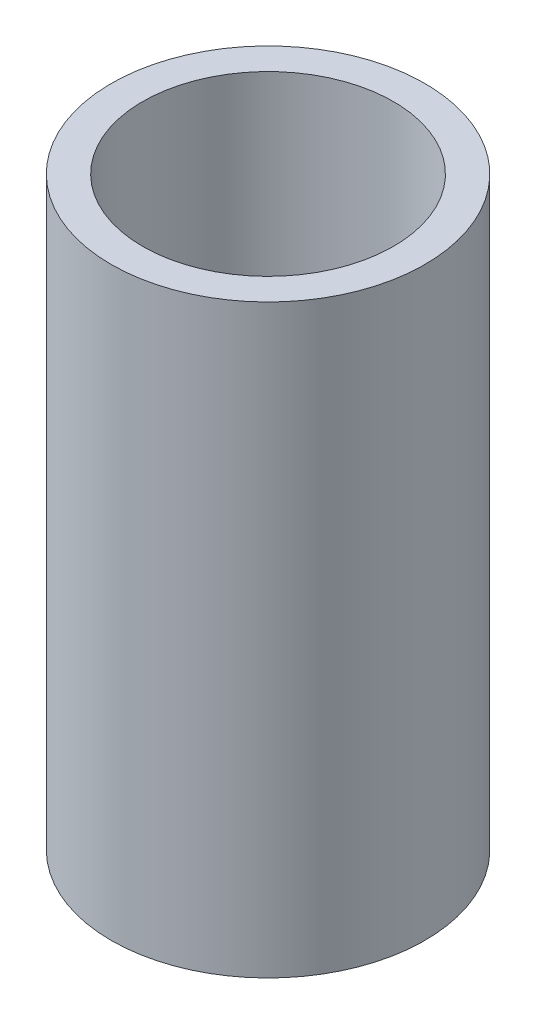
from build123d import *

# Parameters (mm, degrees)
SKETCH1_R           = 7.5
SKETCH1_R_2         = 6
BOSS_EXTRUDE1_DEPTH = 14


with BuildPart() as part:
    # Sketch1 → Boss-Extrude1 (new, symmetric)
    with BuildSketch(Plane(origin=(0, 0, 0), x_dir=(1, 0, 0), z_dir=(0, 1, 0))):
        with Locations(Location((0, 0, 0), (0, 0, 270))):
            Circle(SKETCH1_R)
        with Locations(Location((0, 0, 0), (0, 0, 270))):
            Circle(SKETCH1_R_2, mode=Mode.SUBTRACT)
    extrude(amount=BOSS_EXTRUDE1_DEPTH, both=True)


solid = part.part
